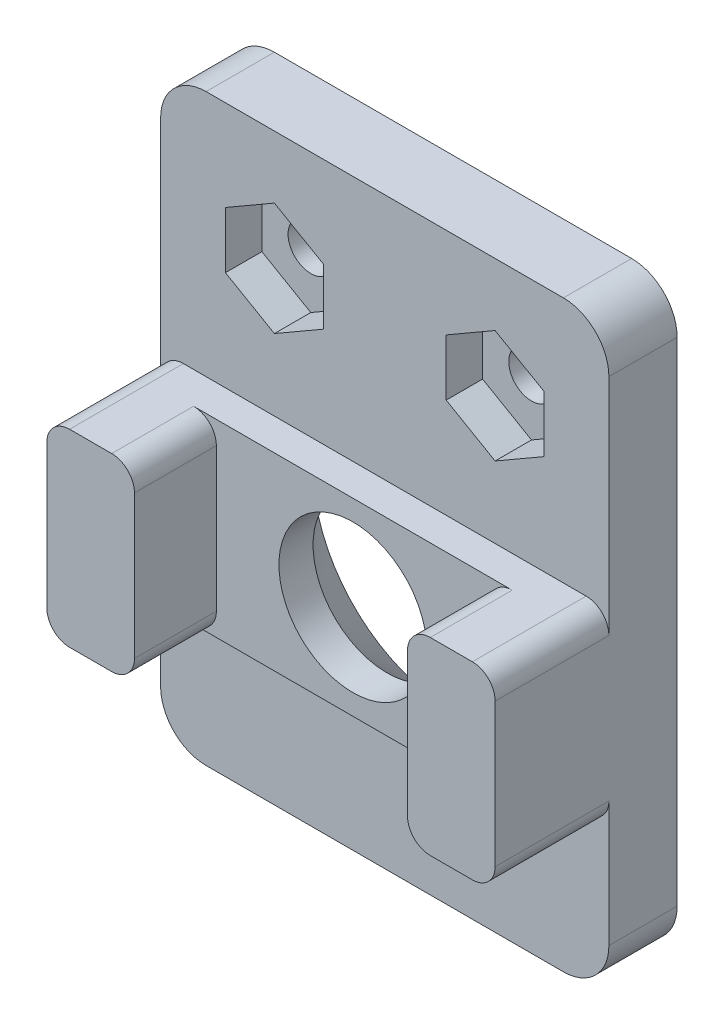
from build123d import *

# Parameters (mm, degrees)
SKETCH_1_W          = 19.7
SKETCH_1_H          = 25.65
SKETCH_1_R          = 3.25
SKETCH_1_R_2        = 1
EXTRUDE_1_DEPTH     = 3
SKETCH_1_3_W        = 3.85
SKETCH_1_3_H        = 8.3
EXTRUDE_2_DEPTH     = 8
FILLET_1_R          = 2
CHAMFER_1_SIZE      = 2.9
FILLET_2_R          = 1
EXTRUDE_START       = 3
EXTRUDE_4_DEPTH     = 1.4
FILLET_3_R          = 1
CUT_EXTRUDE_START   = 1.4
SKETCH_1_5_R        = 1
CUT_EXTRUDE_1_DEPTH = 1.6


with BuildPart() as part:
    # Sketch 1 → Extrude 1 (new body)
    with BuildSketch(Plane.XY):
        with Locations((8.965987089, 2.175)):
            Rectangle(SKETCH_1_W, SKETCH_1_H)
        with Locations((8.965987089, 0)):
            Circle(SKETCH_1_R, mode=Mode.SUBTRACT)
        with Locations((4.115987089, 9.774393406)):
            Circle(SKETCH_1_R_2, mode=Mode.SUBTRACT)
        with Locations((13.815987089, 9.774393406)):
            Circle(SKETCH_1_R_2, mode=Mode.SUBTRACT)
    extrude(amount=EXTRUDE_1_DEPTH)

    # Sketch 1_3 → Extrude 2 (add)
    with BuildSketch(Plane.XY):
        with Locations((1.040987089, 0)):
            Rectangle(SKETCH_1_3_W, SKETCH_1_3_H)
        with Locations((16.890987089, 0)):
            Rectangle(SKETCH_1_3_W, SKETCH_1_3_H)
    extrude(amount=EXTRUDE_2_DEPTH)

    # Fillet 1
    fillet_1_edges = [part.edges().sort_by_distance(p)[0] for p in [
        (-0.884012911, -10.65, 1.5),
        (-0.884012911, 15, 1.5),
        (18.815987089, 15, 1.5),
        (18.815987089, -10.65, 1.5),
    ]]
    fillet(fillet_1_edges, radius=FILLET_1_R)

    # Chamfer 1
    chamfer_1_edges = [part.edges().sort_by_distance(p)[0] for p in [
        (5.715987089, 0, 0),
    ]]
    chamfer(chamfer_1_edges, length=CHAMFER_1_SIZE)

    # Fillet 2
    fillet_2_edges = [part.edges().sort_by_distance(p)[0] for p in [
        (-0.884012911, 4.15, 5.5),
        (-0.884012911, -4.15, 5.5),
        (18.815987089, -4.15, 5.5),
        (18.815987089, 4.15, 5.5),
    ]]
    fillet(fillet_2_edges, radius=FILLET_2_R)

    # Sketch 1_4 → Extrude 4 (add)
    with BuildSketch(Plane.XY.offset(EXTRUDE_START)):
        with BuildLine():
            Line((2.965987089, 0), (2.965987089, -4.15))
            Line((2.965987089, -4.15), (14.965987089, -4.15))
            Line((14.965987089, -4.15), (14.965987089, 0))
            Line((14.965987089, 0), (12.215987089, 0))
            ThreePointArc((12.215987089, 0), (8.965987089, -3.25), (5.715987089, 0))
            Line((5.715987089, 0), (2.965987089, 0))
        make_face()
        with BuildLine():
            Line((14.965987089, 4.15), (2.965987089, 4.15))
            Line((2.965987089, 4.15), (2.965987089, 0))
            Line((2.965987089, 0), (5.715987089, 0))
            ThreePointArc((5.715987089, 0), (8.965987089, 3.25), (12.215987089, 0))
            Line((12.215987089, 0), (14.965987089, 0))
            Line((14.965987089, 0), (14.965987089, 4.15))
        make_face()
    extrude(amount=EXTRUDE_4_DEPTH)

    # Fillet 3
    fillet_3_edges = [part.edges().sort_by_distance(p)[0] for p in [
        (2.965987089, -4.15, 6.2),
        (2.965987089, 4.15, 6.2),
        (14.965987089, -4.15, 6.2),
        (14.965987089, 4.15, 6.2),
    ]]
    fillet(fillet_3_edges, radius=FILLET_3_R)

    # Sketch 1_5 → Cut-Extrude 1 (cut)
    # profile 1 of 2: a face of its own
    with BuildSketch(Plane.XY.offset(CUT_EXTRUDE_START)):
        Polygon((6.265987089, 8.533090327), (6.265987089, 11.015696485), (4.115987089, 12.256999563), (1.965987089, 11.015696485), (1.965987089, 8.533090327), (4.115987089, 7.291787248), align=None)
        with Locations((4.115987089, 9.774393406)):
            Circle(SKETCH_1_5_R, mode=Mode.SUBTRACT)
    # profile 2 of 2: a face of its own
    with BuildSketch(Plane.XY.offset(CUT_EXTRUDE_START)):
        Polygon((15.965987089, 8.533090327), (15.965987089, 11.015696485), (13.815987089, 12.256999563), (11.665987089, 11.015696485), (11.665987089, 8.533090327), (13.815987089, 7.291787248), align=None)
        with Locations((13.815987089, 9.774393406)):
            Circle(SKETCH_1_5_R, mode=Mode.SUBTRACT)
    extrude(amount=CUT_EXTRUDE_1_DEPTH, mode=Mode.SUBTRACT)


solid = part.part
